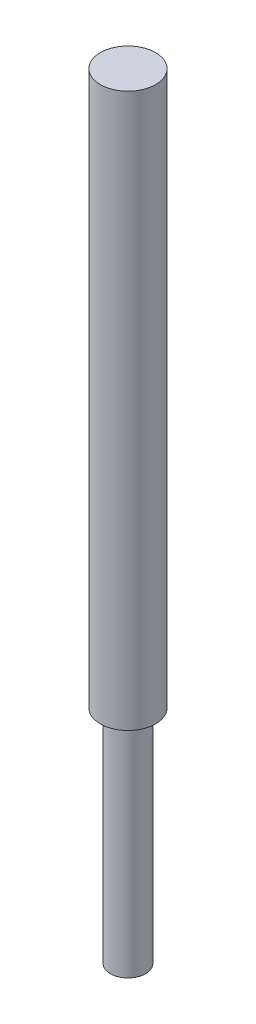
from build123d import *

# Parameters (mm, degrees)
SKETCH1_R           = 6.35
BOSS_EXTRUDE1_DEPTH = 80
SKETCH2_R           = 10
BOSS_EXTRUDE2_DEPTH = 200


with BuildPart() as part:
    # Sketch1 → Boss-Extrude1 (new body)
    with BuildSketch(Plane(origin=(0, 0, 0), x_dir=(1, 0, 0), z_dir=(0, 1, 0))):
        with Locations(Location((0, 0, 0), (0, 0, 270))):
            Circle(SKETCH1_R)
    extrude(amount=BOSS_EXTRUDE1_DEPTH)

    # Sketch2 → Boss-Extrude2 (add)
    with BuildSketch(Plane(origin=(0, 80, 0), x_dir=(1, 0, 0), z_dir=(0, 1, 0))):
        with Locations(Location((0, 0, 0), (0, 0, 270))):
            Circle(SKETCH2_R)
    extrude(amount=BOSS_EXTRUDE2_DEPTH)


solid = part.part
